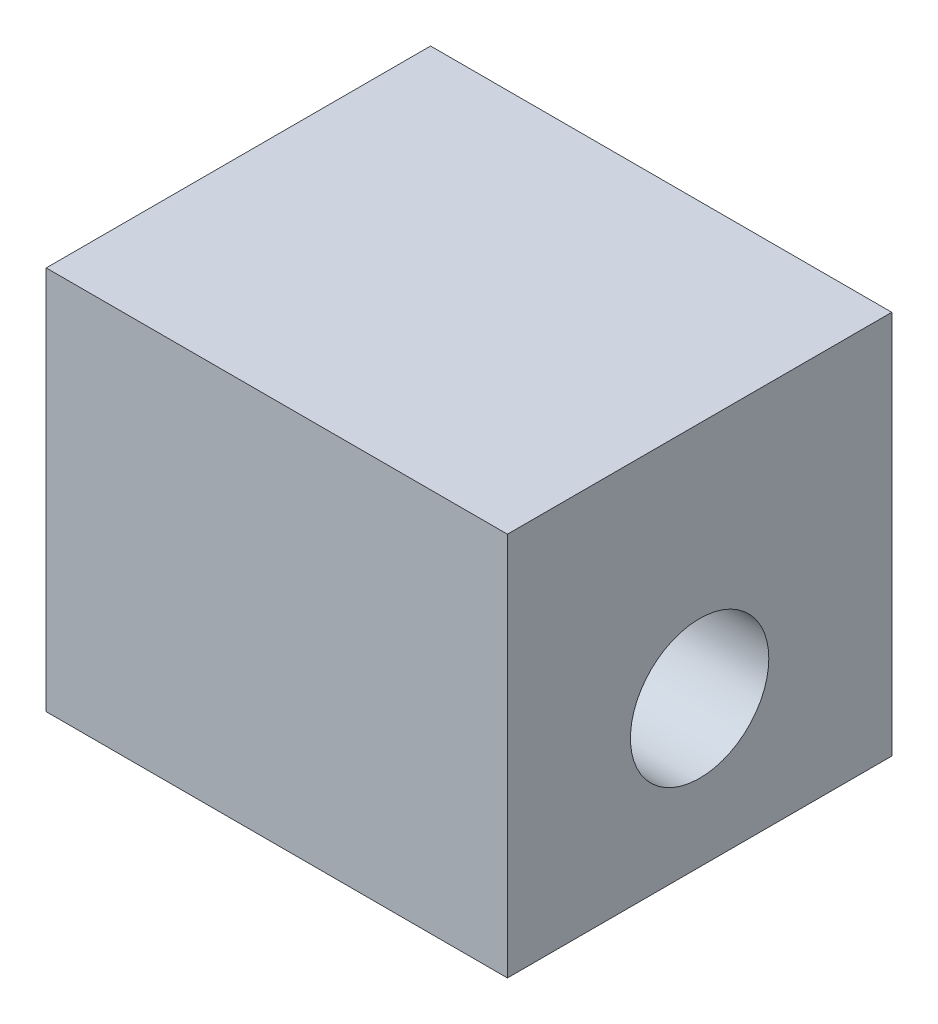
ISO-10303-21;
HEADER;
FILE_DESCRIPTION(('STEP AP214'),'2;1');
FILE_NAME('part.step','',(''),(''),'','','');
FILE_SCHEMA(('AUTOMOTIVE_DESIGN { 1 0 10303 214 1 1 1 1 }'));
ENDSEC;
DATA;
#1=APPLICATION_CONTEXT('core data for automotive mechanical design processes');
#2=APPLICATION_PROTOCOL_DEFINITION('international standard','automotive_design',2000,#1);
#3=PRODUCT_CONTEXT('',#1,'mechanical');
#4=PRODUCT('Part','Part','',(#3));
#5=PRODUCT_RELATED_PRODUCT_CATEGORY('part','',(#4));
#6=PRODUCT_DEFINITION_FORMATION('','',#4);
#7=PRODUCT_DEFINITION_CONTEXT('part definition',#1,'design');
#8=PRODUCT_DEFINITION('design','',#6,#7);
#9=PRODUCT_DEFINITION_SHAPE('','',#8);
#10=(LENGTH_UNIT() NAMED_UNIT(*) SI_UNIT(.MILLI.,.METRE.));
#11=(NAMED_UNIT(*) PLANE_ANGLE_UNIT() SI_UNIT($,.RADIAN.));
#12=(NAMED_UNIT(*) SI_UNIT($,.STERADIAN.) SOLID_ANGLE_UNIT());
#13=UNCERTAINTY_MEASURE_WITH_UNIT(LENGTH_MEASURE(1.E-05),#10,'distance_accuracy_value','');
#14=(GEOMETRIC_REPRESENTATION_CONTEXT(3) GLOBAL_UNCERTAINTY_ASSIGNED_CONTEXT((#13)) GLOBAL_UNIT_ASSIGNED_CONTEXT((#10,
#11,#12)) REPRESENTATION_CONTEXT('',''));
#15=CARTESIAN_POINT('',(0.,0.,0.));
#16=DIRECTION('',(0.,0.,1.));
#17=DIRECTION('',(1.,0.,0.));
#18=AXIS2_PLACEMENT_3D('',#15,#16,#17);
#19=CARTESIAN_POINT('',(-18.0295566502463,10.,-2.80788177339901));
#20=DIRECTION('',(1.,0.,0.));
#21=DIRECTION('',(0.,0.,-1.));
#22=AXIS2_PLACEMENT_3D('',#19,#20,#21);
#23=PLANE('',#22);
#24=CARTESIAN_POINT('',(-18.0295566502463,3.8,2.19211822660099));
#25=DIRECTION('',(1.,0.,0.));
#26=DIRECTION('',(0.,0.,-1.));
#27=AXIS2_PLACEMENT_3D('',#24,#25,#26);
#28=CIRCLE('',#27,1.8);
#29=CARTESIAN_POINT('',(-18.0295566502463,3.8,0.392118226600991));
#30=VERTEX_POINT('',#29);
#31=EDGE_CURVE('E101',#30,#30,#28,.T.);
#32=ORIENTED_EDGE('',*,*,#31,.T.);
#33=EDGE_LOOP('',(#32));
#34=FACE_BOUND('',#33,.T.);
#35=DIRECTION('',(0.,0.,1.));
#36=VECTOR('',#35,1.);
#37=CARTESIAN_POINT('',(-18.0295566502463,0.,-2.80788177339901));
#38=LINE('',#37,#36);
#39=CARTESIAN_POINT('',(-18.0295566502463,0.,-2.80788177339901));
#40=VERTEX_POINT('',#39);
#41=CARTESIAN_POINT('',(-18.0295566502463,0.,7.19211822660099));
#42=VERTEX_POINT('',#41);
#43=EDGE_CURVE('E98',#40,#42,#38,.T.);
#44=ORIENTED_EDGE('',*,*,#43,.T.);
#45=DIRECTION('',(0.,-1.,0.));
#46=VECTOR('',#45,1.);
#47=CARTESIAN_POINT('',(-18.0295566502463,10.,7.19211822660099));
#48=LINE('',#47,#46);
#49=CARTESIAN_POINT('',(-18.0295566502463,10.,7.19211822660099));
#50=VERTEX_POINT('',#49);
#51=EDGE_CURVE('E11',#50,#42,#48,.T.);
#52=ORIENTED_EDGE('',*,*,#51,.F.);
#53=DIRECTION('',(0.,0.,1.));
#54=VECTOR('',#53,1.);
#55=CARTESIAN_POINT('',(-18.0295566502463,10.,-2.80788177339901));
#56=LINE('',#55,#54);
#57=CARTESIAN_POINT('',(-18.0295566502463,10.,-2.80788177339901));
#58=VERTEX_POINT('',#57);
#59=EDGE_CURVE('E86',#58,#50,#56,.T.);
#60=ORIENTED_EDGE('',*,*,#59,.F.);
#61=DIRECTION('',(0.,-1.,0.));
#62=VECTOR('',#61,1.);
#63=CARTESIAN_POINT('',(-18.0295566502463,10.,-2.80788177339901));
#64=LINE('',#63,#62);
#65=EDGE_CURVE('E94',#58,#40,#64,.T.);
#66=ORIENTED_EDGE('',*,*,#65,.T.);
#67=EDGE_LOOP('',(#44,#52,#60,#66));
#68=FACE_BOUND('',#67,.T.);
#69=ADVANCED_FACE('F35',(#34,#68),#23,.F.);
#70=CARTESIAN_POINT('',(-18.0295566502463,10.,7.19211822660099));
#71=DIRECTION('',(0.,0.,-1.));
#72=DIRECTION('',(-1.,0.,0.));
#73=AXIS2_PLACEMENT_3D('',#70,#71,#72);
#74=PLANE('',#73);
#75=DIRECTION('',(1.,0.,0.));
#76=VECTOR('',#75,1.);
#77=CARTESIAN_POINT('',(-18.0295566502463,0.,7.19211822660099));
#78=LINE('',#77,#76);
#79=CARTESIAN_POINT('',(-6.02955665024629,0.,7.19211822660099));
#80=VERTEX_POINT('',#79);
#81=EDGE_CURVE('E90',#42,#80,#78,.T.);
#82=ORIENTED_EDGE('',*,*,#81,.T.);
#83=DIRECTION('',(0.,-1.,0.));
#84=VECTOR('',#83,1.);
#85=CARTESIAN_POINT('',(-6.02955665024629,10.,7.19211822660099));
#86=LINE('',#85,#84);
#87=CARTESIAN_POINT('',(-6.02955665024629,10.,7.19211822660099));
#88=VERTEX_POINT('',#87);
#89=EDGE_CURVE('E43',#88,#80,#86,.T.);
#90=ORIENTED_EDGE('',*,*,#89,.F.);
#91=DIRECTION('',(1.,0.,0.));
#92=VECTOR('',#91,1.);
#93=CARTESIAN_POINT('',(-18.0295566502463,10.,7.19211822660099));
#94=LINE('',#93,#92);
#95=EDGE_CURVE('E81',#50,#88,#94,.T.);
#96=ORIENTED_EDGE('',*,*,#95,.F.);
#97=ORIENTED_EDGE('',*,*,#51,.T.);
#98=EDGE_LOOP('',(#82,#90,#96,#97));
#99=FACE_BOUND('',#98,.T.);
#100=ADVANCED_FACE('F89',(#99),#74,.F.);
#101=CARTESIAN_POINT('',(-6.0295566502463,10.,-2.80788177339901));
#102=DIRECTION('',(-1.,0.,0.));
#103=DIRECTION('',(0.,0.,1.));
#104=AXIS2_PLACEMENT_3D('',#101,#102,#103);
#105=PLANE('',#104);
#106=CARTESIAN_POINT('',(-6.0295566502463,3.8,2.19211822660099));
#107=DIRECTION('',(1.,0.,0.));
#108=DIRECTION('',(0.,0.,-1.));
#109=AXIS2_PLACEMENT_3D('',#106,#107,#108);
#110=CIRCLE('',#109,1.8);
#111=CARTESIAN_POINT('',(-6.02955665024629,3.8,0.392118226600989));
#112=VERTEX_POINT('',#111);
#113=EDGE_CURVE('E112',#112,#112,#110,.T.);
#114=ORIENTED_EDGE('',*,*,#113,.F.);
#115=EDGE_LOOP('',(#114));
#116=FACE_BOUND('',#115,.T.);
#117=DIRECTION('',(0.,0.,-1.));
#118=VECTOR('',#117,1.);
#119=CARTESIAN_POINT('',(-6.0295566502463,0.,-2.80788177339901));
#120=LINE('',#119,#118);
#121=CARTESIAN_POINT('',(-6.0295566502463,0.,-2.80788177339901));
#122=VERTEX_POINT('',#121);
#123=EDGE_CURVE('E68',#80,#122,#120,.T.);
#124=ORIENTED_EDGE('',*,*,#123,.T.);
#125=DIRECTION('',(0.,-1.,0.));
#126=VECTOR('',#125,1.);
#127=CARTESIAN_POINT('',(-6.0295566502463,10.,-2.80788177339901));
#128=LINE('',#127,#126);
#129=CARTESIAN_POINT('',(-6.0295566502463,10.,-2.80788177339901));
#130=VERTEX_POINT('',#129);
#131=EDGE_CURVE('E91',#130,#122,#128,.T.);
#132=ORIENTED_EDGE('',*,*,#131,.F.);
#133=DIRECTION('',(0.,0.,-1.));
#134=VECTOR('',#133,1.);
#135=CARTESIAN_POINT('',(-6.0295566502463,10.,-2.80788177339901));
#136=LINE('',#135,#134);
#137=EDGE_CURVE('E84',#88,#130,#136,.T.);
#138=ORIENTED_EDGE('',*,*,#137,.F.);
#139=ORIENTED_EDGE('',*,*,#89,.T.);
#140=EDGE_LOOP('',(#124,#132,#138,#139));
#141=FACE_BOUND('',#140,.T.);
#142=ADVANCED_FACE('F92',(#116,#141),#105,.F.);
#143=CARTESIAN_POINT('',(-18.0295566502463,10.,-2.80788177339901));
#144=DIRECTION('',(0.,0.,1.));
#145=DIRECTION('',(1.,0.,0.));
#146=AXIS2_PLACEMENT_3D('',#143,#144,#145);
#147=PLANE('',#146);
#148=DIRECTION('',(-1.,0.,0.));
#149=VECTOR('',#148,1.);
#150=CARTESIAN_POINT('',(-18.0295566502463,0.,-2.80788177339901));
#151=LINE('',#150,#149);
#152=EDGE_CURVE('E74',#122,#40,#151,.T.);
#153=ORIENTED_EDGE('',*,*,#152,.T.);
#154=ORIENTED_EDGE('',*,*,#65,.F.);
#155=DIRECTION('',(-1.,0.,0.));
#156=VECTOR('',#155,1.);
#157=CARTESIAN_POINT('',(-18.0295566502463,10.,-2.80788177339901));
#158=LINE('',#157,#156);
#159=EDGE_CURVE('E51',#130,#58,#158,.T.);
#160=ORIENTED_EDGE('',*,*,#159,.F.);
#161=ORIENTED_EDGE('',*,*,#131,.T.);
#162=EDGE_LOOP('',(#153,#154,#160,#161));
#163=FACE_BOUND('',#162,.T.);
#164=ADVANCED_FACE('F106',(#163),#147,.F.);
#165=CARTESIAN_POINT('',(0.,10.,0.));
#166=DIRECTION('',(0.,1.,0.));
#167=DIRECTION('',(0.,0.,1.));
#168=AXIS2_PLACEMENT_3D('',#165,#166,#167);
#169=PLANE('',#168);
#170=ORIENTED_EDGE('',*,*,#59,.T.);
#171=ORIENTED_EDGE('',*,*,#95,.T.);
#172=ORIENTED_EDGE('',*,*,#137,.T.);
#173=ORIENTED_EDGE('',*,*,#159,.T.);
#174=EDGE_LOOP('',(#170,#171,#172,#173));
#175=FACE_BOUND('',#174,.T.);
#176=ADVANCED_FACE('F82',(#175),#169,.T.);
#177=CARTESIAN_POINT('',(0.,0.,0.));
#178=DIRECTION('',(0.,1.,0.));
#179=DIRECTION('',(0.,0.,1.));
#180=AXIS2_PLACEMENT_3D('',#177,#178,#179);
#181=PLANE('',#180);
#182=ORIENTED_EDGE('',*,*,#43,.F.);
#183=ORIENTED_EDGE('',*,*,#152,.F.);
#184=ORIENTED_EDGE('',*,*,#123,.F.);
#185=ORIENTED_EDGE('',*,*,#81,.F.);
#186=EDGE_LOOP('',(#182,#183,#184,#185));
#187=FACE_BOUND('',#186,.T.);
#188=ADVANCED_FACE('F109',(#187),#181,.F.);
#189=CARTESIAN_POINT('',(-18.0295566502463,3.8,2.19211822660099));
#190=DIRECTION('',(1.,0.,0.));
#191=DIRECTION('',(0.,0.,-1.));
#192=AXIS2_PLACEMENT_3D('',#189,#190,#191);
#193=CYLINDRICAL_SURFACE('',#192,1.8);
#194=CARTESIAN_POINT('',(-18.0295566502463,3.8,0.392118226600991));
#195=CARTESIAN_POINT('',(-17.9045566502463,3.8,0.392118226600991));
#196=CARTESIAN_POINT('',(-17.7795566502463,3.8,0.392118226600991));
#197=CARTESIAN_POINT('',(-17.5295566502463,3.8,0.392118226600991));
#198=CARTESIAN_POINT('',(-17.4045566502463,3.8,0.392118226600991));
#199=CARTESIAN_POINT('',(-17.1545566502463,3.8,0.392118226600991));
#200=CARTESIAN_POINT('',(-17.0295566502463,3.8,0.392118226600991));
#201=CARTESIAN_POINT('',(-16.7795566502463,3.8,0.392118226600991));
#202=CARTESIAN_POINT('',(-16.6545566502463,3.8,0.392118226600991));
#203=CARTESIAN_POINT('',(-16.4045566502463,3.8,0.392118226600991));
#204=CARTESIAN_POINT('',(-16.2795566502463,3.8,0.392118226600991));
#205=CARTESIAN_POINT('',(-16.0295566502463,3.8,0.392118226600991));
#206=CARTESIAN_POINT('',(-15.9045566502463,3.8,0.392118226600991));
#207=CARTESIAN_POINT('',(-15.6545566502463,3.8,0.392118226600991));
#208=CARTESIAN_POINT('',(-15.5295566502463,3.8,0.392118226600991));
#209=CARTESIAN_POINT('',(-15.2795566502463,3.8,0.392118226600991));
#210=CARTESIAN_POINT('',(-15.1545566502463,3.8,0.392118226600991));
#211=CARTESIAN_POINT('',(-14.9045566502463,3.8,0.392118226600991));
#212=CARTESIAN_POINT('',(-14.7795566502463,3.8,0.392118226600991));
#213=CARTESIAN_POINT('',(-14.5295566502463,3.8,0.392118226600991));
#214=CARTESIAN_POINT('',(-14.4045566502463,3.8,0.39211822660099));
#215=CARTESIAN_POINT('',(-14.1545566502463,3.8,0.39211822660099));
#216=CARTESIAN_POINT('',(-14.0295566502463,3.8,0.39211822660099));
#217=CARTESIAN_POINT('',(-13.7795566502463,3.8,0.39211822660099));
#218=CARTESIAN_POINT('',(-13.6545566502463,3.8,0.39211822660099));
#219=CARTESIAN_POINT('',(-13.4045566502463,3.8,0.39211822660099));
#220=CARTESIAN_POINT('',(-13.2795566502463,3.8,0.39211822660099));
#221=CARTESIAN_POINT('',(-13.0295566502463,3.8,0.39211822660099));
#222=CARTESIAN_POINT('',(-12.9045566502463,3.8,0.39211822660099));
#223=CARTESIAN_POINT('',(-12.6545566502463,3.8,0.39211822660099));
#224=CARTESIAN_POINT('',(-12.5295566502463,3.8,0.39211822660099));
#225=CARTESIAN_POINT('',(-12.2795566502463,3.8,0.39211822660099));
#226=CARTESIAN_POINT('',(-12.1545566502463,3.8,0.39211822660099));
#227=CARTESIAN_POINT('',(-11.9045566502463,3.8,0.39211822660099));
#228=CARTESIAN_POINT('',(-11.7795566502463,3.8,0.39211822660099));
#229=CARTESIAN_POINT('',(-11.5295566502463,3.8,0.39211822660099));
#230=CARTESIAN_POINT('',(-11.4045566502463,3.8,0.39211822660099));
#231=CARTESIAN_POINT('',(-11.1545566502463,3.8,0.39211822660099));
#232=CARTESIAN_POINT('',(-11.0295566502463,3.8,0.39211822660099));
#233=CARTESIAN_POINT('',(-10.7795566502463,3.8,0.39211822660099));
#234=CARTESIAN_POINT('',(-10.6545566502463,3.8,0.39211822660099));
#235=CARTESIAN_POINT('',(-10.4045566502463,3.8,0.39211822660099));
#236=CARTESIAN_POINT('',(-10.2795566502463,3.8,0.39211822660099));
#237=CARTESIAN_POINT('',(-10.0295566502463,3.8,0.39211822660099));
#238=CARTESIAN_POINT('',(-9.9045566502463,3.8,0.39211822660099));
#239=CARTESIAN_POINT('',(-9.6545566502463,3.8,0.39211822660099));
#240=CARTESIAN_POINT('',(-9.5295566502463,3.8,0.39211822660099));
#241=CARTESIAN_POINT('',(-9.2795566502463,3.8,0.39211822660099));
#242=CARTESIAN_POINT('',(-9.1545566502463,3.8,0.39211822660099));
#243=CARTESIAN_POINT('',(-8.9045566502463,3.8,0.39211822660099));
#244=CARTESIAN_POINT('',(-8.7795566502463,3.8,0.392118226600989));
#245=CARTESIAN_POINT('',(-8.5295566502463,3.8,0.392118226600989));
#246=CARTESIAN_POINT('',(-8.4045566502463,3.8,0.392118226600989));
#247=CARTESIAN_POINT('',(-8.1545566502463,3.8,0.392118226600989));
#248=CARTESIAN_POINT('',(-8.0295566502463,3.8,0.392118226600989));
#249=CARTESIAN_POINT('',(-7.7795566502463,3.8,0.392118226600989));
#250=CARTESIAN_POINT('',(-7.6545566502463,3.8,0.392118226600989));
#251=CARTESIAN_POINT('',(-7.4045566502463,3.8,0.392118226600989));
#252=CARTESIAN_POINT('',(-7.2795566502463,3.8,0.392118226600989));
#253=CARTESIAN_POINT('',(-7.0295566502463,3.8,0.392118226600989));
#254=CARTESIAN_POINT('',(-6.9045566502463,3.8,0.392118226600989));
#255=CARTESIAN_POINT('',(-6.6545566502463,3.8,0.392118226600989));
#256=CARTESIAN_POINT('',(-6.52955665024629,3.8,0.392118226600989));
#257=CARTESIAN_POINT('',(-6.27955665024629,3.8,0.392118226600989));
#258=CARTESIAN_POINT('',(-6.15455665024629,3.8,0.392118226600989));
#259=CARTESIAN_POINT('',(-6.02955665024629,3.8,0.392118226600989));
#260=B_SPLINE_CURVE_WITH_KNOTS('',3,(#194,#195,#196,#197,#198,#199,#200,#201,#202,#203,#204,
#205,#206,#207,#208,#209,#210,#211,#212,#213,#214,#215,#216,#217,#218,#219,#220,#221,#222,#223,
#224,#225,#226,#227,#228,#229,#230,#231,#232,#233,#234,#235,#236,#237,#238,#239,#240,#241,#242,
#243,#244,#245,#246,#247,#248,#249,#250,#251,#252,#253,#254,#255,#256,#257,#258,#259),
.UNSPECIFIED.,.F.,.F.,(4,2,2,2,2,2,2,2,2,2,2,2,2,2,2,2,2,2,2,2,2,2,2,2,2,2,2,2,2,2,2,2,4),(0.,
0.374999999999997,0.749999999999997,1.125,1.5,1.875,2.25,2.625,3.,3.375,3.75,4.125,4.5,4.875,
5.25,5.625,6.,6.375,6.75,7.125,7.5,7.875,8.25,8.625,9.,9.375,9.75,10.125,10.5,10.875,11.25,
11.625,12.),.UNSPECIFIED.);
#261=EDGE_CURVE('BSEAM119',#30,#112,#260,.T.);
#262=ORIENTED_EDGE('',*,*,#31,.F.);
#263=ORIENTED_EDGE('',*,*,#113,.T.);
#264=ORIENTED_EDGE('',*,*,#261,.T.);
#265=ORIENTED_EDGE('',*,*,#261,.F.);
#266=EDGE_LOOP('',(#262,#264,#263,#265));
#267=FACE_BOUND('',#266,.T.);
#268=ADVANCED_FACE('F119',(#267),#193,.F.);
#269=CLOSED_SHELL('',(#69,#100,#142,#164,#176,#188,#268));
#270=MANIFOLD_SOLID_BREP('B2',#269);
#271=ADVANCED_BREP_SHAPE_REPRESENTATION('',(#18,#270),#14);
#272=SHAPE_DEFINITION_REPRESENTATION(#9,#271);
ENDSEC;
END-ISO-10303-21;
